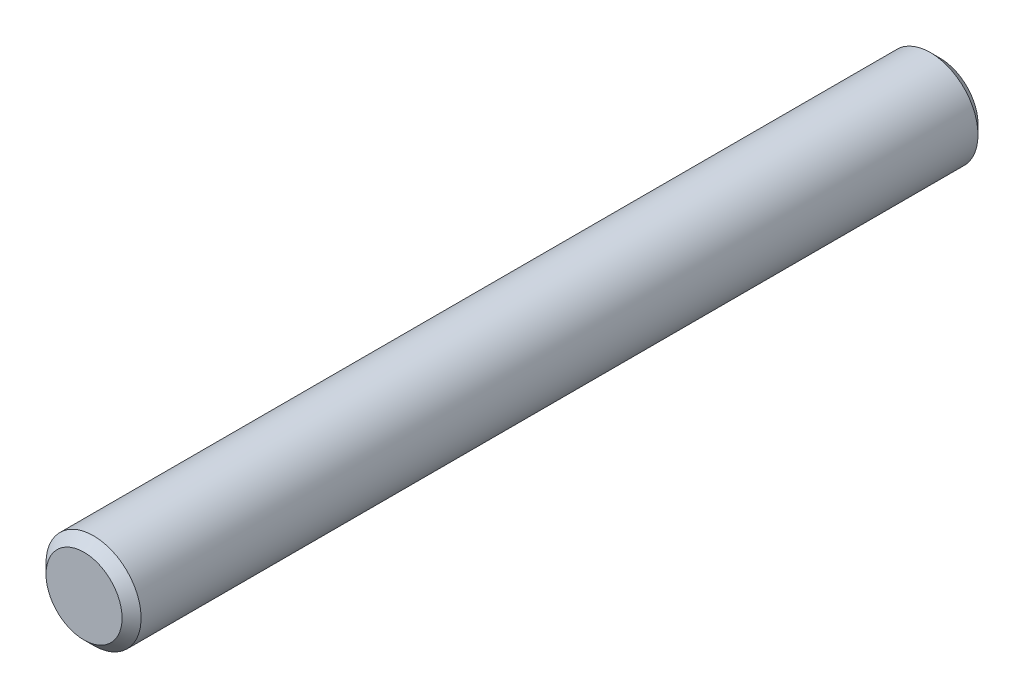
ISO-10303-21;
HEADER;
FILE_DESCRIPTION(('STEP AP214'),'2;1');
FILE_NAME('part.step','',(''),(''),'','','');
FILE_SCHEMA(('AUTOMOTIVE_DESIGN { 1 0 10303 214 1 1 1 1 }'));
ENDSEC;
DATA;
#1=APPLICATION_CONTEXT('core data for automotive mechanical design processes');
#2=APPLICATION_PROTOCOL_DEFINITION('international standard','automotive_design',2000,#1);
#3=PRODUCT_CONTEXT('',#1,'mechanical');
#4=PRODUCT('Part','Part','',(#3));
#5=PRODUCT_RELATED_PRODUCT_CATEGORY('part','',(#4));
#6=PRODUCT_DEFINITION_FORMATION('','',#4);
#7=PRODUCT_DEFINITION_CONTEXT('part definition',#1,'design');
#8=PRODUCT_DEFINITION('design','',#6,#7);
#9=PRODUCT_DEFINITION_SHAPE('','',#8);
#10=(LENGTH_UNIT() NAMED_UNIT(*) SI_UNIT(.MILLI.,.METRE.));
#11=(NAMED_UNIT(*) PLANE_ANGLE_UNIT() SI_UNIT($,.RADIAN.));
#12=(NAMED_UNIT(*) SI_UNIT($,.STERADIAN.) SOLID_ANGLE_UNIT());
#13=UNCERTAINTY_MEASURE_WITH_UNIT(LENGTH_MEASURE(1.E-05),#10,'distance_accuracy_value','');
#14=(GEOMETRIC_REPRESENTATION_CONTEXT(3) GLOBAL_UNCERTAINTY_ASSIGNED_CONTEXT((#13)) GLOBAL_UNIT_ASSIGNED_CONTEXT((#10,
#11,#12)) REPRESENTATION_CONTEXT('',''));
#15=CARTESIAN_POINT('',(0.,0.,0.));
#16=DIRECTION('',(0.,0.,1.));
#17=DIRECTION('',(1.,0.,0.));
#18=AXIS2_PLACEMENT_3D('',#15,#16,#17);
#19=CARTESIAN_POINT('',(0.,0.,22.5));
#20=DIRECTION('',(0.,0.,-1.));
#21=DIRECTION('',(-1.,0.,0.));
#22=AXIS2_PLACEMENT_3D('',#19,#20,#21);
#23=CYLINDRICAL_SURFACE('',#22,2.5);
#24=CARTESIAN_POINT('',(0.,0.,-22.));
#25=DIRECTION('',(0.,0.,1.));
#26=DIRECTION('',(1.,0.,0.));
#27=AXIS2_PLACEMENT_3D('',#24,#25,#26);
#28=CIRCLE('',#27,2.5);
#29=CARTESIAN_POINT('',(-2.5,0.,-22.));
#30=VERTEX_POINT('',#29);
#31=EDGE_CURVE('E38',#30,#30,#28,.T.);
#32=CARTESIAN_POINT('',(0.,0.,22.));
#33=DIRECTION('',(0.,0.,1.));
#34=DIRECTION('',(1.,0.,0.));
#35=AXIS2_PLACEMENT_3D('',#32,#33,#34);
#36=CIRCLE('',#35,2.5);
#37=CARTESIAN_POINT('',(-2.5,0.,22.));
#38=VERTEX_POINT('',#37);
#39=EDGE_CURVE('E42',#38,#38,#36,.F.);
#40=CARTESIAN_POINT('',(-2.5,0.,-22.));
#41=CARTESIAN_POINT('',(-2.5,0.,-21.5416666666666));
#42=CARTESIAN_POINT('',(-2.5,0.,-21.0833333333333));
#43=CARTESIAN_POINT('',(-2.5,0.,-20.1666666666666));
#44=CARTESIAN_POINT('',(-2.5,0.,-19.7083333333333));
#45=CARTESIAN_POINT('',(-2.5,0.,-18.7916666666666));
#46=CARTESIAN_POINT('',(-2.5,0.,-18.3333333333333));
#47=CARTESIAN_POINT('',(-2.5,0.,-17.4166666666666));
#48=CARTESIAN_POINT('',(-2.5,0.,-16.9583333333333));
#49=CARTESIAN_POINT('',(-2.5,0.,-16.0416666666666));
#50=CARTESIAN_POINT('',(-2.5,0.,-15.5833333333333));
#51=CARTESIAN_POINT('',(-2.5,0.,-14.6666666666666));
#52=CARTESIAN_POINT('',(-2.5,0.,-14.2083333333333));
#53=CARTESIAN_POINT('',(-2.5,0.,-13.2916666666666));
#54=CARTESIAN_POINT('',(-2.5,0.,-12.8333333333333));
#55=CARTESIAN_POINT('',(-2.5,0.,-11.9166666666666));
#56=CARTESIAN_POINT('',(-2.5,0.,-11.4583333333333));
#57=CARTESIAN_POINT('',(-2.5,0.,-10.5416666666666));
#58=CARTESIAN_POINT('',(-2.5,0.,-10.0833333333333));
#59=CARTESIAN_POINT('',(-2.5,0.,-9.16666666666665));
#60=CARTESIAN_POINT('',(-2.5,0.,-8.70833333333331));
#61=CARTESIAN_POINT('',(-2.5,0.,-7.79166666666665));
#62=CARTESIAN_POINT('',(-2.5,0.,-7.33333333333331));
#63=CARTESIAN_POINT('',(-2.5,0.,-6.41666666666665));
#64=CARTESIAN_POINT('',(-2.5,0.,-5.95833333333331));
#65=CARTESIAN_POINT('',(-2.5,0.,-5.04166666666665));
#66=CARTESIAN_POINT('',(-2.5,0.,-4.58333333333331));
#67=CARTESIAN_POINT('',(-2.5,0.,-3.66666666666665));
#68=CARTESIAN_POINT('',(-2.5,0.,-3.20833333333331));
#69=CARTESIAN_POINT('',(-2.5,0.,-2.29166666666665));
#70=CARTESIAN_POINT('',(-2.5,0.,-1.83333333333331));
#71=CARTESIAN_POINT('',(-2.5,0.,-0.916666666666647));
#72=CARTESIAN_POINT('',(-2.5,0.,-0.458333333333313));
#73=CARTESIAN_POINT('',(-2.5,0.,0.458333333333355));
#74=CARTESIAN_POINT('',(-2.5,0.,0.916666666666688));
#75=CARTESIAN_POINT('',(-2.5,0.,1.83333333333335));
#76=CARTESIAN_POINT('',(-2.5,0.,2.29166666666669));
#77=CARTESIAN_POINT('',(-2.5,0.,3.20833333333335));
#78=CARTESIAN_POINT('',(-2.5,0.,3.66666666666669));
#79=CARTESIAN_POINT('',(-2.5,0.,4.58333333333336));
#80=CARTESIAN_POINT('',(-2.5,0.,5.04166666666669));
#81=CARTESIAN_POINT('',(-2.5,0.,5.95833333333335));
#82=CARTESIAN_POINT('',(-2.5,0.,6.41666666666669));
#83=CARTESIAN_POINT('',(-2.5,0.,7.33333333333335));
#84=CARTESIAN_POINT('',(-2.5,0.,7.79166666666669));
#85=CARTESIAN_POINT('',(-2.5,0.,8.70833333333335));
#86=CARTESIAN_POINT('',(-2.5,0.,9.16666666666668));
#87=CARTESIAN_POINT('',(-2.5,0.,10.0833333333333));
#88=CARTESIAN_POINT('',(-2.5,0.,10.5416666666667));
#89=CARTESIAN_POINT('',(-2.5,0.,11.4583333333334));
#90=CARTESIAN_POINT('',(-2.5,0.,11.9166666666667));
#91=CARTESIAN_POINT('',(-2.5,0.,12.8333333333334));
#92=CARTESIAN_POINT('',(-2.5,0.,13.2916666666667));
#93=CARTESIAN_POINT('',(-2.5,0.,14.2083333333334));
#94=CARTESIAN_POINT('',(-2.5,0.,14.6666666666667));
#95=CARTESIAN_POINT('',(-2.5,0.,15.5833333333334));
#96=CARTESIAN_POINT('',(-2.5,0.,16.0416666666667));
#97=CARTESIAN_POINT('',(-2.5,0.,16.9583333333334));
#98=CARTESIAN_POINT('',(-2.5,0.,17.4166666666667));
#99=CARTESIAN_POINT('',(-2.5,0.,18.3333333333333));
#100=CARTESIAN_POINT('',(-2.5,0.,18.7916666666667));
#101=CARTESIAN_POINT('',(-2.5,0.,19.7083333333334));
#102=CARTESIAN_POINT('',(-2.5,0.,20.1666666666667));
#103=CARTESIAN_POINT('',(-2.5,0.,21.0833333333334));
#104=CARTESIAN_POINT('',(-2.5,0.,21.5416666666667));
#105=CARTESIAN_POINT('',(-2.5,0.,22.));
#106=B_SPLINE_CURVE_WITH_KNOTS('',3,(#40,#41,#42,#43,#44,#45,#46,#47,#48,#49,#50,#51,#52,#53,
#54,#55,#56,#57,#58,#59,#60,#61,#62,#63,#64,#65,#66,#67,#68,#69,#70,#71,#72,#73,#74,#75,#76,#77,
#78,#79,#80,#81,#82,#83,#84,#85,#86,#87,#88,#89,#90,#91,#92,#93,#94,#95,#96,#97,#98,#99,#100,
#101,#102,#103,#104,#105),.UNSPECIFIED.,.F.,.F.,(4,2,2,2,2,2,2,2,2,2,2,2,2,2,2,2,2,2,2,2,2,2,2,
2,2,2,2,2,2,2,2,2,4),(0.,1.375,2.75,4.125,5.5,6.875,8.25,9.625,11.,12.375,13.75,15.125,16.5,
17.875,19.25,20.625,22.,23.375,24.75,26.125,27.5,28.875,30.25,31.625,33.,34.375,35.75,37.125,
38.5,39.875,41.25,42.625,44.),.UNSPECIFIED.);
#107=EDGE_CURVE('BSEAM28',#30,#38,#106,.T.);
#108=ORIENTED_EDGE('',*,*,#31,.T.);
#109=ORIENTED_EDGE('',*,*,#39,.T.);
#110=ORIENTED_EDGE('',*,*,#107,.T.);
#111=ORIENTED_EDGE('',*,*,#107,.F.);
#112=EDGE_LOOP('',(#108,#110,#109,#111));
#113=FACE_BOUND('',#112,.T.);
#114=ADVANCED_FACE('F28',(#113),#23,.T.);
#115=CARTESIAN_POINT('',(0.,0.,22.5));
#116=DIRECTION('',(0.,0.,1.));
#117=DIRECTION('',(1.,0.,0.));
#118=AXIS2_PLACEMENT_3D('',#115,#116,#117);
#119=PLANE('',#118);
#120=CARTESIAN_POINT('',(0.,0.,22.5));
#121=DIRECTION('',(0.,0.,1.));
#122=DIRECTION('',(1.,0.,0.));
#123=AXIS2_PLACEMENT_3D('',#120,#121,#122);
#124=CIRCLE('',#123,2.00000000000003);
#125=CARTESIAN_POINT('',(2.00000000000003,0.,22.5));
#126=VERTEX_POINT('',#125);
#127=EDGE_CURVE('E10',#126,#126,#124,.T.);
#128=ORIENTED_EDGE('',*,*,#127,.T.);
#129=EDGE_LOOP('',(#128));
#130=FACE_BOUND('',#129,.T.);
#131=ADVANCED_FACE('F61',(#130),#119,.T.);
#132=CARTESIAN_POINT('',(0.,0.,-22.5));
#133=DIRECTION('',(0.,0.,1.));
#134=DIRECTION('',(1.,0.,0.));
#135=AXIS2_PLACEMENT_3D('',#132,#133,#134);
#136=PLANE('',#135);
#137=CARTESIAN_POINT('',(0.,0.,-22.5));
#138=DIRECTION('',(0.,0.,1.));
#139=DIRECTION('',(1.,0.,0.));
#140=AXIS2_PLACEMENT_3D('',#137,#138,#139);
#141=CIRCLE('',#140,1.99999999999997);
#142=CARTESIAN_POINT('',(1.99999999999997,0.,-22.5));
#143=VERTEX_POINT('',#142);
#144=EDGE_CURVE('E34',#143,#143,#141,.F.);
#145=ORIENTED_EDGE('',*,*,#144,.T.);
#146=EDGE_LOOP('',(#145));
#147=FACE_BOUND('',#146,.T.);
#148=ADVANCED_FACE('F57',(#147),#136,.F.);
#149=CARTESIAN_POINT('',(0.,0.,-22.));
#150=DIRECTION('',(0.,0.,1.));
#151=DIRECTION('',(1.,0.,0.));
#152=AXIS2_PLACEMENT_3D('',#149,#150,#151);
#153=CONICAL_SURFACE('',#152,2.5,0.785398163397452);
#154=ORIENTED_EDGE('',*,*,#144,.F.);
#155=EDGE_LOOP('',(#154));
#156=FACE_BOUND('',#155,.T.);
#157=ORIENTED_EDGE('',*,*,#31,.F.);
#158=EDGE_LOOP('',(#157));
#159=FACE_BOUND('',#158,.T.);
#160=ADVANCED_FACE('F52',(#156,#159),#153,.T.);
#161=CARTESIAN_POINT('',(0.,0.,22.5));
#162=DIRECTION('',(0.,0.,-1.));
#163=DIRECTION('',(-1.,0.,0.));
#164=AXIS2_PLACEMENT_3D('',#161,#162,#163);
#165=CONICAL_SURFACE('',#164,2.00000000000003,0.785398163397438);
#166=ORIENTED_EDGE('',*,*,#39,.F.);
#167=EDGE_LOOP('',(#166));
#168=FACE_BOUND('',#167,.T.);
#169=ORIENTED_EDGE('',*,*,#127,.F.);
#170=EDGE_LOOP('',(#169));
#171=FACE_BOUND('',#170,.T.);
#172=ADVANCED_FACE('F49',(#168,#171),#165,.T.);
#173=CLOSED_SHELL('',(#114,#131,#148,#160,#172));
#174=MANIFOLD_SOLID_BREP('B2',#173);
#175=ADVANCED_BREP_SHAPE_REPRESENTATION('',(#18,#174),#14);
#176=SHAPE_DEFINITION_REPRESENTATION(#9,#175);
ENDSEC;
END-ISO-10303-21;
